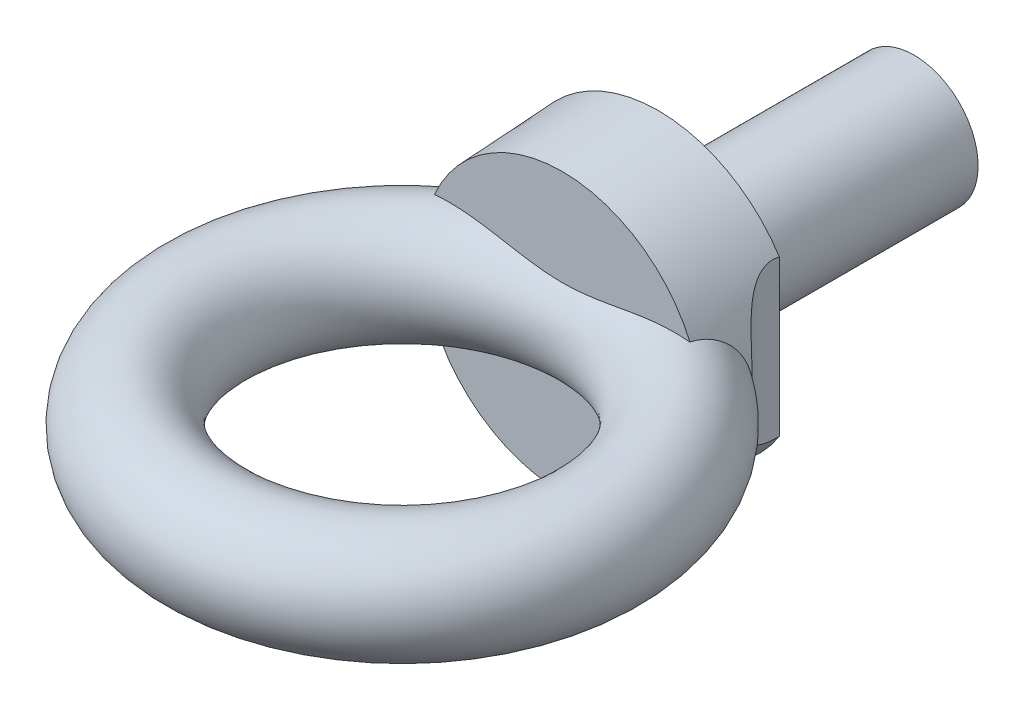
ISO-10303-21;
HEADER;
FILE_DESCRIPTION(('STEP AP214'),'2;1');
FILE_NAME('part.step','',(''),(''),'','','');
FILE_SCHEMA(('AUTOMOTIVE_DESIGN { 1 0 10303 214 1 1 1 1 }'));
ENDSEC;
DATA;
#1=APPLICATION_CONTEXT('core data for automotive mechanical design processes');
#2=APPLICATION_PROTOCOL_DEFINITION('international standard','automotive_design',2000,#1);
#3=PRODUCT_CONTEXT('',#1,'mechanical');
#4=PRODUCT('Part','Part','',(#3));
#5=PRODUCT_RELATED_PRODUCT_CATEGORY('part','',(#4));
#6=PRODUCT_DEFINITION_FORMATION('','',#4);
#7=PRODUCT_DEFINITION_CONTEXT('part definition',#1,'design');
#8=PRODUCT_DEFINITION('design','',#6,#7);
#9=PRODUCT_DEFINITION_SHAPE('','',#8);
#10=(LENGTH_UNIT() NAMED_UNIT(*) SI_UNIT(.MILLI.,.METRE.));
#11=(NAMED_UNIT(*) PLANE_ANGLE_UNIT() SI_UNIT($,.RADIAN.));
#12=(NAMED_UNIT(*) SI_UNIT($,.STERADIAN.) SOLID_ANGLE_UNIT());
#13=UNCERTAINTY_MEASURE_WITH_UNIT(LENGTH_MEASURE(1.E-05),#10,'distance_accuracy_value','');
#14=(GEOMETRIC_REPRESENTATION_CONTEXT(3) GLOBAL_UNCERTAINTY_ASSIGNED_CONTEXT((#13)) GLOBAL_UNIT_ASSIGNED_CONTEXT((#10,
#11,#12)) REPRESENTATION_CONTEXT('',''));
#15=CARTESIAN_POINT('',(0.,0.,0.));
#16=DIRECTION('',(0.,0.,1.));
#17=DIRECTION('',(1.,0.,0.));
#18=AXIS2_PLACEMENT_3D('',#15,#16,#17);
#19=CARTESIAN_POINT('',(0.,0.,12.));
#20=DIRECTION('',(0.,0.,-1.));
#21=DIRECTION('',(-1.,0.,0.));
#22=AXIS2_PLACEMENT_3D('',#19,#20,#21);
#23=CONICAL_SURFACE('',#22,17.4,0.0499583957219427);
#24=CARTESIAN_POINT('',(0.,0.,0.));
#25=DIRECTION('',(0.,0.,-1.));
#26=DIRECTION('',(-1.,0.,0.));
#27=AXIS2_PLACEMENT_3D('',#24,#25,#26);
#28=CIRCLE('',#27,18.);
#29=CARTESIAN_POINT('',(15.1556328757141,-9.71116842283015,0.));
#30=VERTEX_POINT('',#29);
#31=CARTESIAN_POINT('',(-15.1556328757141,-9.71116842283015,0.));
#32=VERTEX_POINT('',#31);
#33=EDGE_CURVE('E98',#30,#32,#28,.T.);
#34=ORIENTED_EDGE('',*,*,#33,.F.);
#35=CARTESIAN_POINT('',(15.155666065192,-9.71113516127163,-0.000199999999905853));
#36=CARTESIAN_POINT('',(15.1391001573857,-9.72773806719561,0.0994587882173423));
#37=CARTESIAN_POINT('',(15.1249930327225,-9.74035112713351,0.200195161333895));
#38=CARTESIAN_POINT('',(15.1018637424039,-9.75751734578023,0.402905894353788));
#39=CARTESIAN_POINT('',(15.0928403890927,-9.76207238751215,0.504879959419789));
#40=CARTESIAN_POINT('',(15.0800799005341,-9.76304700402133,0.70852979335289));
#41=CARTESIAN_POINT('',(15.0763086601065,-9.75951946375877,0.810203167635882));
#42=CARTESIAN_POINT('',(15.0739246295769,-9.74453525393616,1.01301697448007));
#43=CARTESIAN_POINT('',(15.0753117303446,-9.73307875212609,1.11415741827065));
#44=CARTESIAN_POINT('',(15.0830999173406,-9.70245408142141,1.31501551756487));
#45=CARTESIAN_POINT('',(15.0894985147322,-9.68328974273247,1.41473385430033));
#46=CARTESIAN_POINT('',(15.1070344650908,-9.63757620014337,1.6120547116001));
#47=CARTESIAN_POINT('',(15.1181738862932,-9.6110237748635,1.70965628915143));
#48=CARTESIAN_POINT('',(15.1582017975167,-9.52082660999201,1.99836007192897));
#49=CARTESIAN_POINT('',(15.1936997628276,-9.44664259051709,2.18535745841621));
#50=CARTESIAN_POINT('',(15.2878284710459,-9.25543862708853,2.58292554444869));
#51=CARTESIAN_POINT('',(15.3497990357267,-9.13262817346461,2.7898684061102));
#52=CARTESIAN_POINT('',(15.4873886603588,-8.85820942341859,3.17865256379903));
#53=CARTESIAN_POINT('',(15.5630286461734,-8.70655695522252,3.36045460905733));
#54=CARTESIAN_POINT('',(15.69848391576,-8.42844204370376,3.64931957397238));
#55=CARTESIAN_POINT('',(15.7564844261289,-8.30752379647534,3.76272040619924));
#56=CARTESIAN_POINT('',(15.874406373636,-8.05621164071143,3.97747018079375));
#57=CARTESIAN_POINT('',(15.9343285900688,-7.9258138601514,4.07881415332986));
#58=CARTESIAN_POINT('',(16.0546281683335,-7.6570050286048,4.27026047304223));
#59=CARTESIAN_POINT('',(16.1150059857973,-7.51858465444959,4.3603493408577));
#60=CARTESIAN_POINT('',(16.2349611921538,-7.2351174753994,4.53006615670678));
#61=CARTESIAN_POINT('',(16.294538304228,-7.09006845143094,4.60969056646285));
#62=CARTESIAN_POINT('',(16.4461501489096,-6.70817289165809,4.80304809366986));
#63=CARTESIAN_POINT('',(16.5368454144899,-6.46713541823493,4.90958304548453));
#64=CARTESIAN_POINT('',(16.7109393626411,-5.97445397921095,5.10215249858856));
#65=CARTESIAN_POINT('',(16.7943338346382,-5.72280401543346,5.18817521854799));
#66=CARTESIAN_POINT('',(16.9520376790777,-5.21099272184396,5.34286811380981));
#67=CARTESIAN_POINT('',(17.0263311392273,-4.95081746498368,5.41150811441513));
#68=CARTESIAN_POINT('',(17.164366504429,-4.42428143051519,5.5338297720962));
#69=CARTESIAN_POINT('',(17.2281090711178,-4.15792104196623,5.58751236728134));
#70=CARTESIAN_POINT('',(17.3282218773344,-3.69439772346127,5.66902791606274));
#71=CARTESIAN_POINT('',(17.3672997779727,-3.49834091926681,5.69991015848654));
#72=CARTESIAN_POINT('',(17.4392306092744,-3.10422140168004,5.75555721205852));
#73=CARTESIAN_POINT('',(17.4720830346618,-2.90615852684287,5.78032152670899));
#74=CARTESIAN_POINT('',(17.5610362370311,-2.30949677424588,5.84627789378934));
#75=CARTESIAN_POINT('',(17.6075212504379,-1.90847862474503,5.87912425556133));
#76=CARTESIAN_POINT('',(17.673996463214,-1.10253392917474,5.92551062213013));
#77=CARTESIAN_POINT('',(17.6939412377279,-0.69760187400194,5.93901752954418));
#78=CARTESIAN_POINT('',(17.7068870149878,0.112810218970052,5.94782138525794));
#79=CARTESIAN_POINT('',(17.6998929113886,0.518290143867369,5.94312164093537));
#80=CARTESIAN_POINT('',(17.6587378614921,1.33372784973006,5.91488614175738));
#81=CARTESIAN_POINT('',(17.6241489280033,1.74365500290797,5.89105360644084));
#82=CARTESIAN_POINT('',(17.5519739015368,2.35478746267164,5.83922858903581));
#83=CARTESIAN_POINT('',(17.5245208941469,2.55794001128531,5.81926473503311));
#84=CARTESIAN_POINT('',(17.462991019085,2.96257027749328,5.77350104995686));
#85=CARTESIAN_POINT('',(17.4289149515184,3.16404819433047,5.7477019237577));
#86=CARTESIAN_POINT('',(17.3544547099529,3.56419252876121,5.68980181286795));
#87=CARTESIAN_POINT('',(17.314092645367,3.76286623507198,5.65772281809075));
#88=CARTESIAN_POINT('',(17.2272379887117,4.15756933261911,5.58651627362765));
#89=CARTESIAN_POINT('',(17.1807463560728,4.35359913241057,5.5473898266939));
#90=CARTESIAN_POINT('',(17.0820097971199,4.74229365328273,5.46129154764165));
#91=CARTESIAN_POINT('',(17.0297695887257,4.93496098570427,5.41432613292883));
#92=CARTESIAN_POINT('',(16.919971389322,5.31635464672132,5.31157038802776));
#93=CARTESIAN_POINT('',(16.8624146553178,5.50508189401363,5.2557821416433));
#94=CARTESIAN_POINT('',(16.7477432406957,5.86174379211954,5.13949503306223));
#95=CARTESIAN_POINT('',(16.6910172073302,6.03006957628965,5.07981536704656));
#96=CARTESIAN_POINT('',(16.5742382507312,6.3619708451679,4.95120319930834));
#97=CARTESIAN_POINT('',(16.5141856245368,6.52554675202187,4.88227152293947));
#98=CARTESIAN_POINT('',(16.3915672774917,6.84694363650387,4.7341494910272));
#99=CARTESIAN_POINT('',(16.3290026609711,7.00476708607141,4.65496361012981));
#100=CARTESIAN_POINT('',(16.2023608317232,7.31356306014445,4.48522211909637));
#101=CARTESIAN_POINT('',(16.1382838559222,7.46453664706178,4.394668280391));
#102=CARTESIAN_POINT('',(16.0215324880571,7.73167309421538,4.21858795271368));
#103=CARTESIAN_POINT('',(15.9688894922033,7.8491973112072,4.13510881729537));
#104=CARTESIAN_POINT('',(15.8643578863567,8.07778175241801,3.95919496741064));
#105=CARTESIAN_POINT('',(15.8124694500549,8.18884050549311,3.86675822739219));
#106=CARTESIAN_POINT('',(15.7106114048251,8.40319928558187,3.67260118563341));
#107=CARTESIAN_POINT('',(15.6606390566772,8.50651060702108,3.57089489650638));
#108=CARTESIAN_POINT('',(15.5638217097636,8.7042305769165,3.35784295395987));
#109=CARTESIAN_POINT('',(15.5169763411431,8.79864027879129,3.24649844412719));
#110=CARTESIAN_POINT('',(15.4079197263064,9.01703820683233,2.96202946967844));
#111=CARTESIAN_POINT('',(15.3481716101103,9.13544295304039,2.78349653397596));
#112=CARTESIAN_POINT('',(15.2694665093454,9.2929856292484,2.50162269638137));
#113=CARTESIAN_POINT('',(15.2450457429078,9.34216661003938,2.40529040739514));
#114=CARTESIAN_POINT('',(15.2004583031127,9.43323137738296,2.20830038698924));
#115=CARTESIAN_POINT('',(15.1802897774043,9.47511833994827,2.10764456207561));
#116=CARTESIAN_POINT('',(15.1446220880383,9.5513625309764,1.9015025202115));
#117=CARTESIAN_POINT('',(15.1291728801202,9.58563821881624,1.79597738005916));
#118=CARTESIAN_POINT('',(15.1037791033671,9.64550336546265,1.58189282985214));
#119=CARTESIAN_POINT('',(15.0938315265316,9.67109756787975,1.4733351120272));
#120=CARTESIAN_POINT('',(15.0798666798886,9.71311066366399,1.25416653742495));
#121=CARTESIAN_POINT('',(15.0758444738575,9.72953718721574,1.14355746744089));
#122=CARTESIAN_POINT('',(15.0739810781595,9.75289213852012,0.921338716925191));
#123=CARTESIAN_POINT('',(15.0761368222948,9.75982527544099,0.809729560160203));
#124=CARTESIAN_POINT('',(15.0869955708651,9.76412721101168,0.580703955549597));
#125=CARTESIAN_POINT('',(15.0960396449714,9.76096942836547,0.463293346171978));
#126=CARTESIAN_POINT('',(15.1208602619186,9.74400790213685,0.230045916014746));
#127=CARTESIAN_POINT('',(15.1366320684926,9.73021164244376,0.114208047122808));
#128=CARTESIAN_POINT('',(15.1556660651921,9.71113516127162,-0.000200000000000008));
#129=B_SPLINE_CURVE_WITH_KNOTS('',3,(#35,#36,#37,#38,#39,#40,#41,#42,#43,#44,#45,#46,#47,#48,
#49,#50,#51,#52,#53,#54,#55,#56,#57,#58,#59,#60,#61,#62,#63,#64,#65,#66,#67,#68,#69,#70,#71,#72,
#73,#74,#75,#76,#77,#78,#79,#80,#81,#82,#83,#84,#85,#86,#87,#88,#89,#90,#91,#92,#93,#94,#95,#96,
#97,#98,#99,#100,#101,#102,#103,#104,#105,#106,#107,#108,#109,#110,#111,#112,#113,#114,#115,
#116,#117,#118,#119,#120,#121,#122,#123,#124,#125,#126,#127,#128),.UNSPECIFIED.,.F.,.F.,(4,2,2,
2,2,2,2,2,2,2,2,2,2,2,2,2,2,2,2,2,2,2,2,2,2,2,2,2,2,2,2,2,2,2,2,2,2,2,2,2,2,2,2,2,2,2,4),(0.,
0.307039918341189,0.614008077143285,0.918973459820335,1.22393239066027,1.52873996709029,
1.83368065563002,2.44357363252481,3.18515149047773,3.92787436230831,4.45408368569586,
4.98050916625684,5.50755918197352,6.03478694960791,6.86956868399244,7.7048287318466,
8.54152892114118,9.37817662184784,9.98483366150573,10.5915399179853,11.8051194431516,
13.0207734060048,14.2362065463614,15.4708659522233,16.0886138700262,16.7062872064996,
17.3218351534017,17.9372868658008,18.552237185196,19.167042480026,19.7289112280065,
20.2907298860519,20.8523042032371,21.4137911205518,21.8738378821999,22.3339889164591,
22.7934555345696,23.2528677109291,23.9171432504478,24.2494649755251,24.5816416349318,
24.9172215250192,25.2526177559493,25.5877344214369,25.9226847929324,26.2753939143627,
26.6278551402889),.UNSPECIFIED.);
#130=CARTESIAN_POINT('',(17.7027496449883,-1.94289029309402E-11,5.94500710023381));
#131=VERTEX_POINT('',#130);
#132=EDGE_CURVE('E54',#30,#131,#129,.T.);
#133=ORIENTED_EDGE('',*,*,#132,.T.);
#134=CARTESIAN_POINT('',(15.967211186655,6.9143198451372,12.0002));
#135=CARTESIAN_POINT('',(15.9898595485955,6.8872780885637,11.7989461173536));
#136=CARTESIAN_POINT('',(16.0153478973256,6.85340626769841,11.5988512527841));
#137=CARTESIAN_POINT('',(16.0717891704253,6.77125328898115,11.2022638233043));
#138=CARTESIAN_POINT('',(16.1027465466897,6.72296036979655,11.0057743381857));
#139=CARTESIAN_POINT('',(16.1699377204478,6.611149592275,10.6176399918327));
#140=CARTESIAN_POINT('',(16.2061816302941,6.54760240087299,10.4260052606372));
#141=CARTESIAN_POINT('',(16.2833131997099,6.40494797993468,10.049631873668));
#142=CARTESIAN_POINT('',(16.3241995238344,6.32584522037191,9.86489125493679));
#143=CARTESIAN_POINT('',(16.410018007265,6.15151938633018,9.50292998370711));
#144=CARTESIAN_POINT('',(16.4549697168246,6.05621624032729,9.32575243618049));
#145=CARTESIAN_POINT('',(16.5476664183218,5.84999708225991,8.98146363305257));
#146=CARTESIAN_POINT('',(16.5954117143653,5.73907936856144,8.8143534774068));
#147=CARTESIAN_POINT('',(16.6923500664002,5.50241106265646,8.49191767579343));
#148=CARTESIAN_POINT('',(16.7415404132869,5.37668704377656,8.33657171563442));
#149=CARTESIAN_POINT('',(16.8400955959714,5.11109743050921,8.03855657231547));
#150=CARTESIAN_POINT('',(16.889460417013,4.97123300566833,7.89588634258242));
#151=CARTESIAN_POINT('',(16.9832240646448,4.68973426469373,7.63469596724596));
#152=CARTESIAN_POINT('',(17.0277122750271,4.54906825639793,7.51516190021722));
#153=CARTESIAN_POINT('',(17.1146264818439,4.25752269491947,7.28831514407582));
#154=CARTESIAN_POINT('',(17.1570517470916,4.10663956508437,7.18100677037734));
#155=CARTESIAN_POINT('',(17.2388365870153,3.79574055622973,6.9791400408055));
#156=CARTESIAN_POINT('',(17.2781954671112,3.63572262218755,6.88458457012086));
#157=CARTESIAN_POINT('',(17.3529482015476,3.30764623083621,6.708596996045));
#158=CARTESIAN_POINT('',(17.3883402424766,3.13958414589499,6.62717088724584));
#159=CARTESIAN_POINT('',(17.4544149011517,2.79628257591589,6.47761775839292));
#160=CARTESIAN_POINT('',(17.4850866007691,2.62102760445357,6.4095214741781));
#161=CARTESIAN_POINT('',(17.5409294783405,2.2650081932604,6.28710706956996));
#162=CARTESIAN_POINT('',(17.5661030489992,2.08424618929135,6.2327829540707));
#163=CARTESIAN_POINT('',(17.610422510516,1.71835041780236,6.13802279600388));
#164=CARTESIAN_POINT('',(17.6295670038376,1.53321564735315,6.09758997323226));
#165=CARTESIAN_POINT('',(17.6614030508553,1.15995078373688,6.03075137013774));
#166=CARTESIAN_POINT('',(17.6740967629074,0.97182171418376,6.0043408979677));
#167=CARTESIAN_POINT('',(17.6929409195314,0.590337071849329,5.9652409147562));
#168=CARTESIAN_POINT('',(17.6989677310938,0.396948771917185,5.95281058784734));
#169=CARTESIAN_POINT('',(17.7039276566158,0.00969346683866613,5.94257574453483));
#170=CARTESIAN_POINT('',(17.7028606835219,-0.184173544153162,5.94477140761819));
#171=CARTESIAN_POINT('',(17.6936567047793,-0.571006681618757,5.96378240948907));
#172=CARTESIAN_POINT('',(17.6855202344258,-0.763972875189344,5.98059664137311));
#173=CARTESIAN_POINT('',(17.6623528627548,-1.14772214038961,6.0288072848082));
#174=CARTESIAN_POINT('',(17.6473196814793,-1.33850446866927,6.06020851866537));
#175=CARTESIAN_POINT('',(17.6106082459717,-1.71732227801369,6.13768407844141));
#176=CARTESIAN_POINT('',(17.588900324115,-1.90534148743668,6.18382395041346));
#177=CARTESIAN_POINT('',(17.5393536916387,-2.27638993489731,6.29059831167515));
#178=CARTESIAN_POINT('',(17.5115150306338,-2.45941921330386,6.35123268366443));
#179=CARTESIAN_POINT('',(17.450337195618,-2.81920984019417,6.48682383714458));
#180=CARTESIAN_POINT('',(17.416996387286,-2.99596930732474,6.56178487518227));
#181=CARTESIAN_POINT('',(17.3456143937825,-3.341795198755,6.72572273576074));
#182=CARTESIAN_POINT('',(17.3075749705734,-3.51086447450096,6.81469430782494));
#183=CARTESIAN_POINT('',(17.228009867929,-3.83882588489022,7.00556460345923));
#184=CARTESIAN_POINT('',(17.1865139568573,-3.99778759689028,7.10735616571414));
#185=CARTESIAN_POINT('',(17.1007779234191,-4.30579981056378,7.32395169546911));
#186=CARTESIAN_POINT('',(17.056537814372,-4.45485036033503,7.43875559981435));
#187=CARTESIAN_POINT('',(16.9664261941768,-4.74185325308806,7.68070495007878));
#188=CARTESIAN_POINT('',(16.9205558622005,-4.87981339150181,7.80784158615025));
#189=CARTESIAN_POINT('',(16.8282845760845,-5.1437821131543,8.07378831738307));
#190=CARTESIAN_POINT('',(16.7818836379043,-5.26979105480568,8.21259806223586));
#191=CARTESIAN_POINT('',(16.6906235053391,-5.50661791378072,8.49806794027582));
#192=CARTESIAN_POINT('',(16.6457521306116,-5.6176921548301,8.64451167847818));
#193=CARTESIAN_POINT('',(16.5576192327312,-5.82700962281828,8.94675583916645));
#194=CARTESIAN_POINT('',(16.5143577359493,-5.92525263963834,9.10255641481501));
#195=CARTESIAN_POINT('',(16.4303451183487,-6.10862207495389,9.42254402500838));
#196=CARTESIAN_POINT('',(16.389596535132,-6.19373536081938,9.58673924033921));
#197=CARTESIAN_POINT('',(16.3114677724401,-6.35058269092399,9.92214097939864));
#198=CARTESIAN_POINT('',(16.2740871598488,-6.42231845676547,10.0933465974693));
#199=CARTESIAN_POINT('',(16.2104622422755,-6.53938896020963,10.4063787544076));
#200=CARTESIAN_POINT('',(16.1834923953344,-6.5871304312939,10.5471669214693));
#201=CARTESIAN_POINT('',(16.132328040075,-6.67432500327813,10.8317768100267));
#202=CARTESIAN_POINT('',(16.1081334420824,-6.71377837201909,10.975598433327));
#203=CARTESIAN_POINT('',(16.0627481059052,-6.78452157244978,11.2652107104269));
#204=CARTESIAN_POINT('',(16.0415483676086,-6.81583611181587,11.4109939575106));
#205=CARTESIAN_POINT('',(16.0021304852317,-6.8707680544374,11.7043705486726));
#206=CARTESIAN_POINT('',(15.9839116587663,-6.89438722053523,11.8519634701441));
#207=CARTESIAN_POINT('',(15.967211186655,-6.9143198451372,12.0002));
#208=B_SPLINE_CURVE_WITH_KNOTS('',3,(#134,#135,#136,#137,#138,#139,#140,#141,#142,#143,#144,
#145,#146,#147,#148,#149,#150,#151,#152,#153,#154,#155,#156,#157,#158,#159,#160,#161,#162,#163,
#164,#165,#166,#167,#168,#169,#170,#171,#172,#173,#174,#175,#176,#177,#178,#179,#180,#181,#182,
#183,#184,#185,#186,#187,#188,#189,#190,#191,#192,#193,#194,#195,#196,#197,#198,#199,#200,#201,
#202,#203,#204,#205,#206,#207),.UNSPECIFIED.,.F.,.F.,(4,2,2,2,2,2,2,2,2,2,2,2,2,2,2,2,2,2,2,2,2,
2,2,2,2,2,2,2,2,2,2,2,2,2,2,2,4),(0.,0.612944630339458,1.22639052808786,1.84102563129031,
2.4554843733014,3.07307345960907,3.69072990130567,4.30729424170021,4.92380762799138,
5.49277626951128,6.06194512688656,6.63124253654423,7.2007991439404,7.77165395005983,
8.34225983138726,8.91299788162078,9.48354484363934,10.0645035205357,10.6454693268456,
11.2263911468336,11.8075051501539,12.3912403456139,12.9749708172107,13.5588749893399,
14.1425608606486,14.7216566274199,15.3007495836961,15.8794318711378,16.4580967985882,
17.0250221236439,17.5919567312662,18.1594547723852,18.7268797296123,19.1798694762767,
19.6328445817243,20.0844280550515,20.5359080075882),.UNSPECIFIED.);
#209=CARTESIAN_POINT('',(15.9672337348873,-6.91429293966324,12.));
#210=VERTEX_POINT('',#209);
#211=EDGE_CURVE('E95',#131,#210,#208,.T.);
#212=ORIENTED_EDGE('',*,*,#211,.T.);
#213=CARTESIAN_POINT('',(0.,0.,12.));
#214=DIRECTION('',(0.,0.,-1.));
#215=DIRECTION('',(-1.,0.,0.));
#216=AXIS2_PLACEMENT_3D('',#213,#214,#215);
#217=CIRCLE('',#216,17.4);
#218=CARTESIAN_POINT('',(-15.9672337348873,-6.91429293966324,12.));
#219=VERTEX_POINT('',#218);
#220=EDGE_CURVE('E156',#210,#219,#217,.T.);
#221=ORIENTED_EDGE('',*,*,#220,.T.);
#222=CARTESIAN_POINT('',(-15.967211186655,-6.9143198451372,12.0002));
#223=CARTESIAN_POINT('',(-15.9898595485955,-6.8872780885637,11.7989461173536));
#224=CARTESIAN_POINT('',(-16.0153478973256,-6.85340626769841,11.5988512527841));
#225=CARTESIAN_POINT('',(-16.0717891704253,-6.77125328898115,11.2022638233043));
#226=CARTESIAN_POINT('',(-16.1027465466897,-6.72296036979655,11.0057743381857));
#227=CARTESIAN_POINT('',(-16.1699377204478,-6.611149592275,10.6176399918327));
#228=CARTESIAN_POINT('',(-16.2061816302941,-6.54760240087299,10.4260052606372));
#229=CARTESIAN_POINT('',(-16.2833131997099,-6.40494797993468,10.049631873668));
#230=CARTESIAN_POINT('',(-16.3241995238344,-6.32584522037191,9.86489125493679));
#231=CARTESIAN_POINT('',(-16.410018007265,-6.15151938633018,9.50292998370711));
#232=CARTESIAN_POINT('',(-16.4549697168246,-6.05621624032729,9.32575243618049));
#233=CARTESIAN_POINT('',(-16.5476664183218,-5.84999708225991,8.98146363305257));
#234=CARTESIAN_POINT('',(-16.5954117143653,-5.73907936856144,8.8143534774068));
#235=CARTESIAN_POINT('',(-16.6923500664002,-5.50241106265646,8.49191767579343));
#236=CARTESIAN_POINT('',(-16.7415404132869,-5.37668704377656,8.33657171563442));
#237=CARTESIAN_POINT('',(-16.8400955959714,-5.11109743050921,8.03855657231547));
#238=CARTESIAN_POINT('',(-16.889460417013,-4.97123300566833,7.89588634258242));
#239=CARTESIAN_POINT('',(-16.9832240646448,-4.68973426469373,7.63469596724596));
#240=CARTESIAN_POINT('',(-17.0277122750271,-4.54906825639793,7.51516190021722));
#241=CARTESIAN_POINT('',(-17.1146264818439,-4.25752269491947,7.28831514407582));
#242=CARTESIAN_POINT('',(-17.1570517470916,-4.10663956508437,7.18100677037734));
#243=CARTESIAN_POINT('',(-17.2388365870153,-3.79574055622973,6.9791400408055));
#244=CARTESIAN_POINT('',(-17.2781954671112,-3.63572262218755,6.88458457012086));
#245=CARTESIAN_POINT('',(-17.3529482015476,-3.30764623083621,6.708596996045));
#246=CARTESIAN_POINT('',(-17.3883402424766,-3.13958414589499,6.62717088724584));
#247=CARTESIAN_POINT('',(-17.4544149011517,-2.79628257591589,6.47761775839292));
#248=CARTESIAN_POINT('',(-17.4850866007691,-2.62102760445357,6.4095214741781));
#249=CARTESIAN_POINT('',(-17.5409294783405,-2.2650081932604,6.28710706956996));
#250=CARTESIAN_POINT('',(-17.5661030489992,-2.08424618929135,6.2327829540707));
#251=CARTESIAN_POINT('',(-17.610422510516,-1.71835041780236,6.13802279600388));
#252=CARTESIAN_POINT('',(-17.6295670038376,-1.53321564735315,6.09758997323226));
#253=CARTESIAN_POINT('',(-17.6614030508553,-1.15995078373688,6.03075137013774));
#254=CARTESIAN_POINT('',(-17.6740967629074,-0.97182171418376,6.0043408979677));
#255=CARTESIAN_POINT('',(-17.6929409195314,-0.590337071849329,5.9652409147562));
#256=CARTESIAN_POINT('',(-17.6989677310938,-0.396948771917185,5.95281058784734));
#257=CARTESIAN_POINT('',(-17.7039276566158,-0.00969346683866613,5.94257574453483));
#258=CARTESIAN_POINT('',(-17.7028606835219,0.184173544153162,5.94477140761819));
#259=CARTESIAN_POINT('',(-17.6936567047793,0.571006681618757,5.96378240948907));
#260=CARTESIAN_POINT('',(-17.6855202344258,0.763972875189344,5.98059664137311));
#261=CARTESIAN_POINT('',(-17.6623528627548,1.14772214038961,6.0288072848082));
#262=CARTESIAN_POINT('',(-17.6473196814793,1.33850446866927,6.06020851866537));
#263=CARTESIAN_POINT('',(-17.6106082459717,1.71732227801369,6.13768407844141));
#264=CARTESIAN_POINT('',(-17.588900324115,1.90534148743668,6.18382395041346));
#265=CARTESIAN_POINT('',(-17.5393536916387,2.27638993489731,6.29059831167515));
#266=CARTESIAN_POINT('',(-17.5115150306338,2.45941921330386,6.35123268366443));
#267=CARTESIAN_POINT('',(-17.450337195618,2.81920984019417,6.48682383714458));
#268=CARTESIAN_POINT('',(-17.416996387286,2.99596930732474,6.56178487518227));
#269=CARTESIAN_POINT('',(-17.3456143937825,3.341795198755,6.72572273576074));
#270=CARTESIAN_POINT('',(-17.3075749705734,3.51086447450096,6.81469430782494));
#271=CARTESIAN_POINT('',(-17.228009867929,3.83882588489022,7.00556460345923));
#272=CARTESIAN_POINT('',(-17.1865139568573,3.99778759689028,7.10735616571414));
#273=CARTESIAN_POINT('',(-17.1007779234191,4.30579981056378,7.32395169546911));
#274=CARTESIAN_POINT('',(-17.056537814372,4.45485036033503,7.43875559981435));
#275=CARTESIAN_POINT('',(-16.9664261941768,4.74185325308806,7.68070495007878));
#276=CARTESIAN_POINT('',(-16.9205558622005,4.87981339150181,7.80784158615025));
#277=CARTESIAN_POINT('',(-16.8282845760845,5.1437821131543,8.07378831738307));
#278=CARTESIAN_POINT('',(-16.7818836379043,5.26979105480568,8.21259806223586));
#279=CARTESIAN_POINT('',(-16.6906235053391,5.50661791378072,8.49806794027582));
#280=CARTESIAN_POINT('',(-16.6457521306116,5.6176921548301,8.64451167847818));
#281=CARTESIAN_POINT('',(-16.5576192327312,5.82700962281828,8.94675583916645));
#282=CARTESIAN_POINT('',(-16.5143577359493,5.92525263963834,9.10255641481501));
#283=CARTESIAN_POINT('',(-16.4303451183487,6.10862207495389,9.42254402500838));
#284=CARTESIAN_POINT('',(-16.389596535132,6.19373536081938,9.58673924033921));
#285=CARTESIAN_POINT('',(-16.3114677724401,6.35058269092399,9.92214097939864));
#286=CARTESIAN_POINT('',(-16.2740871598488,6.42231845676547,10.0933465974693));
#287=CARTESIAN_POINT('',(-16.2104622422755,6.53938896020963,10.4063787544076));
#288=CARTESIAN_POINT('',(-16.1834923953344,6.5871304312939,10.5471669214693));
#289=CARTESIAN_POINT('',(-16.132328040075,6.67432500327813,10.8317768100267));
#290=CARTESIAN_POINT('',(-16.1081334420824,6.71377837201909,10.975598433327));
#291=CARTESIAN_POINT('',(-16.0627481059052,6.78452157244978,11.2652107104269));
#292=CARTESIAN_POINT('',(-16.0415483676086,6.81583611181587,11.4109939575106));
#293=CARTESIAN_POINT('',(-16.0021304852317,6.8707680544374,11.7043705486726));
#294=CARTESIAN_POINT('',(-15.9839116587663,6.89438722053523,11.8519634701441));
#295=CARTESIAN_POINT('',(-15.967211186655,6.9143198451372,12.0002));
#296=B_SPLINE_CURVE_WITH_KNOTS('',3,(#222,#223,#224,#225,#226,#227,#228,#229,#230,#231,#232,
#233,#234,#235,#236,#237,#238,#239,#240,#241,#242,#243,#244,#245,#246,#247,#248,#249,#250,#251,
#252,#253,#254,#255,#256,#257,#258,#259,#260,#261,#262,#263,#264,#265,#266,#267,#268,#269,#270,
#271,#272,#273,#274,#275,#276,#277,#278,#279,#280,#281,#282,#283,#284,#285,#286,#287,#288,#289,
#290,#291,#292,#293,#294,#295),.UNSPECIFIED.,.F.,.F.,(4,2,2,2,2,2,2,2,2,2,2,2,2,2,2,2,2,2,2,2,2,
2,2,2,2,2,2,2,2,2,2,2,2,2,2,2,4),(0.,0.612944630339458,1.22639052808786,1.84102563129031,
2.4554843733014,3.07307345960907,3.69072990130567,4.30729424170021,4.92380762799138,
5.49277626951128,6.06194512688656,6.63124253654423,7.2007991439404,7.77165395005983,
8.34225983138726,8.91299788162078,9.48354484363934,10.0645035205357,10.6454693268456,
11.2263911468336,11.8075051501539,12.3912403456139,12.9749708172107,13.5588749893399,
14.1425608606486,14.7216566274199,15.3007495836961,15.8794318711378,16.4580967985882,
17.0250221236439,17.5919567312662,18.1594547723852,18.7268797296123,19.1798694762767,
19.6328445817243,20.0844280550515,20.5359080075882),.UNSPECIFIED.);
#297=CARTESIAN_POINT('',(-17.7027496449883,-9.71445146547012E-12,5.94500710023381));
#298=VERTEX_POINT('',#297);
#299=EDGE_CURVE('E108',#219,#298,#296,.T.);
#300=ORIENTED_EDGE('',*,*,#299,.T.);
#301=CARTESIAN_POINT('',(-15.1556660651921,9.71113516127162,-0.000200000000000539));
#302=CARTESIAN_POINT('',(-15.1391001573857,9.72773806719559,0.0994587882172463));
#303=CARTESIAN_POINT('',(-15.1249930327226,9.74035112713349,0.200195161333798));
#304=CARTESIAN_POINT('',(-15.1018637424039,9.75751734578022,0.402905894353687));
#305=CARTESIAN_POINT('',(-15.0928403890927,9.76207238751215,0.504879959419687));
#306=CARTESIAN_POINT('',(-15.0800799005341,9.76304700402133,0.708529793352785));
#307=CARTESIAN_POINT('',(-15.0763086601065,9.75951946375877,0.810203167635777));
#308=CARTESIAN_POINT('',(-15.0739246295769,9.74453525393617,1.01301697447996));
#309=CARTESIAN_POINT('',(-15.0753117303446,9.7330787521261,1.11415741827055));
#310=CARTESIAN_POINT('',(-15.0830999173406,9.70245408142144,1.31501551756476));
#311=CARTESIAN_POINT('',(-15.0894985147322,9.6832897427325,1.41473385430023));
#312=CARTESIAN_POINT('',(-15.1070344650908,9.6375762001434,1.61205471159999));
#313=CARTESIAN_POINT('',(-15.1181738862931,9.61102377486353,1.70965628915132));
#314=CARTESIAN_POINT('',(-15.1582017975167,9.52082660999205,1.99836007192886));
#315=CARTESIAN_POINT('',(-15.1936997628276,9.44664259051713,2.18535745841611));
#316=CARTESIAN_POINT('',(-15.2878284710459,9.2554386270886,2.58292554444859));
#317=CARTESIAN_POINT('',(-15.3497990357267,9.13262817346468,2.78986840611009));
#318=CARTESIAN_POINT('',(-15.4873886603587,8.85820942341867,3.17865256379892));
#319=CARTESIAN_POINT('',(-15.5630286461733,8.70655695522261,3.36045460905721));
#320=CARTESIAN_POINT('',(-15.6984839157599,8.42844204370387,3.64931957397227));
#321=CARTESIAN_POINT('',(-15.7564844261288,8.30752379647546,3.76272040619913));
#322=CARTESIAN_POINT('',(-15.874406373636,8.05621164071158,3.97747018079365));
#323=CARTESIAN_POINT('',(-15.9343285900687,7.92581386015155,4.07881415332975));
#324=CARTESIAN_POINT('',(-16.0546281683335,7.65700502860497,4.27026047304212));
#325=CARTESIAN_POINT('',(-16.1150059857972,7.51858465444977,4.3603493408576));
#326=CARTESIAN_POINT('',(-16.2349611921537,7.2351174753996,4.53006615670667));
#327=CARTESIAN_POINT('',(-16.2945383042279,7.09006845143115,4.60969056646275));
#328=CARTESIAN_POINT('',(-16.4461501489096,6.70817289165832,4.80304809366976));
#329=CARTESIAN_POINT('',(-16.5368454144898,6.46713541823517,4.90958304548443));
#330=CARTESIAN_POINT('',(-16.710939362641,5.97445397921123,5.10215249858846));
#331=CARTESIAN_POINT('',(-16.7943338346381,5.72280401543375,5.1881752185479));
#332=CARTESIAN_POINT('',(-16.9520376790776,5.21099272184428,5.34286811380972));
#333=CARTESIAN_POINT('',(-17.0263311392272,4.95081746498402,5.41150811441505));
#334=CARTESIAN_POINT('',(-17.1643665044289,4.42428143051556,5.53382977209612));
#335=CARTESIAN_POINT('',(-17.2281090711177,4.15792104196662,5.58751236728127));
#336=CARTESIAN_POINT('',(-17.3282218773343,3.69439772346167,5.66902791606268));
#337=CARTESIAN_POINT('',(-17.3672997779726,3.49834091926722,5.69991015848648));
#338=CARTESIAN_POINT('',(-17.4392306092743,3.10422140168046,5.75555721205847));
#339=CARTESIAN_POINT('',(-17.4720830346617,2.9061585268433,5.78032152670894));
#340=CARTESIAN_POINT('',(-17.561036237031,2.30949677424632,5.84627789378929));
#341=CARTESIAN_POINT('',(-17.6075212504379,1.90847862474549,5.8791242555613));
#342=CARTESIAN_POINT('',(-17.6739964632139,1.10253392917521,5.92551062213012));
#343=CARTESIAN_POINT('',(-17.6939412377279,0.697601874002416,5.93901752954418));
#344=CARTESIAN_POINT('',(-17.7068870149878,-0.11281021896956,5.94782138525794));
#345=CARTESIAN_POINT('',(-17.6998929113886,-0.518290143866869,5.94312164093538));
#346=CARTESIAN_POINT('',(-17.6587378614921,-1.33372784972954,5.91488614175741));
#347=CARTESIAN_POINT('',(-17.6241489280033,-1.74365500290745,5.89105360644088));
#348=CARTESIAN_POINT('',(-17.5519739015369,-2.35478746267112,5.83922858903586));
#349=CARTESIAN_POINT('',(-17.524520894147,-2.55794001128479,5.81926473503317));
#350=CARTESIAN_POINT('',(-17.4629910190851,-2.96257027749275,5.77350104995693));
#351=CARTESIAN_POINT('',(-17.4289149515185,-3.16404819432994,5.74770192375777));
#352=CARTESIAN_POINT('',(-17.354454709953,-3.56419252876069,5.68980181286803));
#353=CARTESIAN_POINT('',(-17.3140926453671,-3.76286623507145,5.65772281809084));
#354=CARTESIAN_POINT('',(-17.2272379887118,-4.15756933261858,5.58651627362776));
#355=CARTESIAN_POINT('',(-17.1807463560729,-4.35359913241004,5.54738982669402));
#356=CARTESIAN_POINT('',(-17.0820097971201,-4.7422936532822,5.46129154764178));
#357=CARTESIAN_POINT('',(-17.0297695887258,-4.93496098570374,5.41432613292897));
#358=CARTESIAN_POINT('',(-16.9199713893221,-5.31635464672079,5.31157038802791));
#359=CARTESIAN_POINT('',(-16.862414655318,-5.5050818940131,5.25578214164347));
#360=CARTESIAN_POINT('',(-16.7477432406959,-5.86174379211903,5.13949503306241));
#361=CARTESIAN_POINT('',(-16.6910172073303,-6.03006957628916,5.07981536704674));
#362=CARTESIAN_POINT('',(-16.5742382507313,-6.36197084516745,4.95120319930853));
#363=CARTESIAN_POINT('',(-16.514185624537,-6.52554675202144,4.88227152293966));
#364=CARTESIAN_POINT('',(-16.3915672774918,-6.84694363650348,4.73414949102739));
#365=CARTESIAN_POINT('',(-16.3290026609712,-7.00476708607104,4.65496361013));
#366=CARTESIAN_POINT('',(-16.2023608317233,-7.31356306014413,4.48522211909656));
#367=CARTESIAN_POINT('',(-16.1382838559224,-7.46453664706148,4.3946682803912));
#368=CARTESIAN_POINT('',(-16.0215324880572,-7.73167309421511,4.21858795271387));
#369=CARTESIAN_POINT('',(-15.9688894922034,-7.84919731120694,4.13510881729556));
#370=CARTESIAN_POINT('',(-15.8643578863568,-8.07778175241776,3.95919496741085));
#371=CARTESIAN_POINT('',(-15.812469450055,-8.18884050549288,3.8667582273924));
#372=CARTESIAN_POINT('',(-15.7106114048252,-8.40319928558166,3.67260118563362));
#373=CARTESIAN_POINT('',(-15.6606390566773,-8.50651060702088,3.57089489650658));
#374=CARTESIAN_POINT('',(-15.5638217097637,-8.70423057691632,3.35784295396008));
#375=CARTESIAN_POINT('',(-15.5169763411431,-8.79864027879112,3.2464984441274));
#376=CARTESIAN_POINT('',(-15.4079197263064,-9.0170382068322,2.96202946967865));
#377=CARTESIAN_POINT('',(-15.3481716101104,-9.13544295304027,2.78349653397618));
#378=CARTESIAN_POINT('',(-15.2694665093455,-9.2929856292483,2.50162269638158));
#379=CARTESIAN_POINT('',(-15.2450457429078,-9.34216661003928,2.40529040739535));
#380=CARTESIAN_POINT('',(-15.2004583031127,-9.43323137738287,2.20830038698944));
#381=CARTESIAN_POINT('',(-15.1802897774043,-9.47511833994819,2.10764456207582));
#382=CARTESIAN_POINT('',(-15.1446220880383,-9.55136253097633,1.9015025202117));
#383=CARTESIAN_POINT('',(-15.1291728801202,-9.58563821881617,1.79597738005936));
#384=CARTESIAN_POINT('',(-15.1037791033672,-9.6455033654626,1.58189282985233));
#385=CARTESIAN_POINT('',(-15.0938315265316,-9.67109756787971,1.4733351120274));
#386=CARTESIAN_POINT('',(-15.0798666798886,-9.71311066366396,1.25416653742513));
#387=CARTESIAN_POINT('',(-15.0758444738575,-9.72953718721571,1.14355746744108));
#388=CARTESIAN_POINT('',(-15.0739810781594,-9.7528921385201,0.921338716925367));
#389=CARTESIAN_POINT('',(-15.0761368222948,-9.75982527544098,0.809729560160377));
#390=CARTESIAN_POINT('',(-15.0869955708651,-9.76412721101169,0.580703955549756));
#391=CARTESIAN_POINT('',(-15.0960396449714,-9.76096942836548,0.463293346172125));
#392=CARTESIAN_POINT('',(-15.1208602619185,-9.74400790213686,0.230045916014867));
#393=CARTESIAN_POINT('',(-15.1366320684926,-9.73021164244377,0.114208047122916));
#394=CARTESIAN_POINT('',(-15.155666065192,-9.71113516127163,-0.000199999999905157));
#395=B_SPLINE_CURVE_WITH_KNOTS('',3,(#301,#302,#303,#304,#305,#306,#307,#308,#309,#310,#311,
#312,#313,#314,#315,#316,#317,#318,#319,#320,#321,#322,#323,#324,#325,#326,#327,#328,#329,#330,
#331,#332,#333,#334,#335,#336,#337,#338,#339,#340,#341,#342,#343,#344,#345,#346,#347,#348,#349,
#350,#351,#352,#353,#354,#355,#356,#357,#358,#359,#360,#361,#362,#363,#364,#365,#366,#367,#368,
#369,#370,#371,#372,#373,#374,#375,#376,#377,#378,#379,#380,#381,#382,#383,#384,#385,#386,#387,
#388,#389,#390,#391,#392,#393,#394),.UNSPECIFIED.,.F.,.F.,(4,2,2,2,2,2,2,2,2,2,2,2,2,2,2,2,2,2,
2,2,2,2,2,2,2,2,2,2,2,2,2,2,2,2,2,2,2,2,2,2,2,2,2,2,2,2,4),(0.,0.307039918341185,
0.614008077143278,0.918973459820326,1.22393239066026,1.52873996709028,1.83368065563,
2.44357363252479,3.18515149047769,3.92787436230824,4.45408368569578,4.98050916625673,
5.50755918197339,6.03478694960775,6.86956868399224,7.70482873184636,8.5415289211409,
9.37817662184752,9.98483366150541,10.591539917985,11.8051194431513,13.0207734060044,
14.236206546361,15.4708659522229,16.0886138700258,16.7062872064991,17.3218351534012,
17.9372868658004,18.5522371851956,19.1670424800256,19.7289112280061,20.2907298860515,
20.8523042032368,21.4137911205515,21.8738378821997,22.3339889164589,22.7934555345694,
23.2528677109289,23.9171432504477,24.249464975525,24.5816416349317,24.9172215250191,
25.2526177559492,25.5877344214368,25.9226847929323,26.2753939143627,26.6278551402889),.UNSPECIFIED.);
#396=EDGE_CURVE('E99',#298,#32,#395,.T.);
#397=ORIENTED_EDGE('',*,*,#396,.T.);
#398=EDGE_LOOP('',(#34,#133,#212,#221,#300,#397));
#399=FACE_BOUND('',#398,.T.);
#400=ADVANCED_FACE('F38',(#399),#23,.T.);
#401=CARTESIAN_POINT('',(0.,0.,12.));
#402=DIRECTION('',(0.,0.,-1.));
#403=DIRECTION('',(-1.,0.,0.));
#404=AXIS2_PLACEMENT_3D('',#401,#402,#403);
#405=PLANE('',#404);
#406=ORIENTED_EDGE('',*,*,#220,.F.);
#407=CARTESIAN_POINT('',(0.,5.3619026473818,12.));
#408=CARTESIAN_POINT('',(0.276856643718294,5.36189780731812,12.));
#409=CARTESIAN_POINT('',(0.553706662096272,5.36674583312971,12.));
#410=CARTESIAN_POINT('',(1.1070799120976,5.38588839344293,12.));
#411=CARTESIAN_POINT('',(1.38360314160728,5.40018298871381,12.));
#412=CARTESIAN_POINT('',(1.93612508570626,5.43755047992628,12.));
#413=CARTESIAN_POINT('',(2.21212362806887,5.46062588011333,12.));
#414=CARTESIAN_POINT('',(2.76335885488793,5.51450828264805,12.));
#415=CARTESIAN_POINT('',(3.0385955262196,5.54531541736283,12.));
#416=CARTESIAN_POINT('',(3.86557661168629,5.6477391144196,12.));
#417=CARTESIAN_POINT('',(4.41609047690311,5.72916718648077,12.));
#418=CARTESIAN_POINT('',(5.51467985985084,5.9062611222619,12.));
#419=CARTESIAN_POINT('',(6.06275537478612,6.00192700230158,12.));
#420=CARTESIAN_POINT('',(7.16352179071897,6.19654393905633,12.));
#421=CARTESIAN_POINT('',(7.71620870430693,6.29551713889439,12.));
#422=CARTESIAN_POINT('',(8.82319460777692,6.48468542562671,12.));
#423=CARTESIAN_POINT('',(9.3774937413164,6.57487970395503,12.));
#424=CARTESIAN_POINT('',(10.486885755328,6.73571670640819,12.));
#425=CARTESIAN_POINT('',(11.0419676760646,6.80643219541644,12.));
#426=CARTESIAN_POINT('',(12.1550334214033,6.91873472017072,12.));
#427=CARTESIAN_POINT('',(12.7130158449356,6.96033470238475,12.));
#428=CARTESIAN_POINT('',(13.6886534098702,6.99873722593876,12.));
#429=CARTESIAN_POINT('',(14.105946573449,7.00423549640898,12.));
#430=CARTESIAN_POINT('',(14.9405427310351,6.98904273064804,12.));
#431=CARTESIAN_POINT('',(15.3578453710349,6.96832725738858,12.));
#432=CARTESIAN_POINT('',(16.188554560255,6.8962059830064,12.));
#433=CARTESIAN_POINT('',(16.6019693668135,6.8449002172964,12.));
#434=CARTESIAN_POINT('',(17.4226451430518,6.70703207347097,12.));
#435=CARTESIAN_POINT('',(17.8299107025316,6.62049749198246,12.));
#436=CARTESIAN_POINT('',(18.7335682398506,6.38095588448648,12.));
#437=CARTESIAN_POINT('',(19.2271217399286,6.21680831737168,12.));
#438=CARTESIAN_POINT('',(20.1848043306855,5.8171723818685,12.));
#439=CARTESIAN_POINT('',(20.6489558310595,5.58173915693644,12.));
#440=CARTESIAN_POINT('',(21.4415387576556,5.08705918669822,12.));
#441=CARTESIAN_POINT('',(21.7786015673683,4.84186524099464,12.));
#442=CARTESIAN_POINT('',(22.2508865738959,4.43582493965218,12.));
#443=CARTESIAN_POINT('',(22.4027497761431,4.29411944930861,12.));
#444=CARTESIAN_POINT('',(22.6936582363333,3.99805607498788,12.));
#445=CARTESIAN_POINT('',(22.832705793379,3.84370046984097,12.));
#446=CARTESIAN_POINT('',(23.0726957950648,3.55122582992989,12.));
#447=CARTESIAN_POINT('',(23.1760283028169,3.41506292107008,12.));
#448=CARTESIAN_POINT('',(23.3715323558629,3.13495750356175,12.));
#449=CARTESIAN_POINT('',(23.4637060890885,2.9910165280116,12.));
#450=CARTESIAN_POINT('',(23.6357727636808,2.69598946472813,12.));
#451=CARTESIAN_POINT('',(23.7156677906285,2.54490459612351,12.));
#452=CARTESIAN_POINT('',(23.8621282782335,2.2363866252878,12.));
#453=CARTESIAN_POINT('',(23.9286935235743,2.07895342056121,12.));
#454=CARTESIAN_POINT('',(24.0478550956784,1.75786204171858,12.));
#455=CARTESIAN_POINT('',(24.1003706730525,1.59417381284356,12.));
#456=CARTESIAN_POINT('',(24.1901042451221,1.26264321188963,12.));
#457=CARTESIAN_POINT('',(24.2273220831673,1.09480079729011,12.));
#458=CARTESIAN_POINT('',(24.28582753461,0.756410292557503,12.));
#459=CARTESIAN_POINT('',(24.3071201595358,0.585863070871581,12.));
#460=CARTESIAN_POINT('',(24.333422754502,0.243523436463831,12.));
#461=CARTESIAN_POINT('',(24.3384341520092,0.0717311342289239,12.));
#462=CARTESIAN_POINT('',(24.3324014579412,-0.254907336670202,12.));
#463=CARTESIAN_POINT('',(24.3228652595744,-0.409783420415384,12.));
#464=CARTESIAN_POINT('',(24.2905806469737,-0.718206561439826,12.));
#465=CARTESIAN_POINT('',(24.26782778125,-0.871753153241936,12.));
#466=CARTESIAN_POINT('',(24.209439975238,-1.17628745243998,12.));
#467=CARTESIAN_POINT('',(24.1738117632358,-1.32727645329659,12.));
#468=CARTESIAN_POINT('',(24.0901398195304,-1.62582687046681,12.));
#469=CARTESIAN_POINT('',(24.0420913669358,-1.77338696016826,12.));
#470=CARTESIAN_POINT('',(23.9343207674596,-2.0637962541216,12.));
#471=CARTESIAN_POINT('',(23.8746253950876,-2.20665540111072,12.));
#472=CARTESIAN_POINT('',(23.7442100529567,-2.48727017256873,12.));
#473=CARTESIAN_POINT('',(23.6734861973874,-2.62502397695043,12.));
#474=CARTESIAN_POINT('',(23.4459487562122,-3.02957013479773,12.));
#475=CARTESIAN_POINT('',(23.2736989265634,-3.28783350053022,12.));
#476=CARTESIAN_POINT('',(22.8747388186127,-3.8036906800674,12.));
#477=CARTESIAN_POINT('',(22.6441780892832,-4.05827096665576,12.));
#478=CARTESIAN_POINT('',(22.149816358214,-4.53274658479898,12.));
#479=CARTESIAN_POINT('',(21.8859999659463,-4.75262575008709,12.));
#480=CARTESIAN_POINT('',(21.3976398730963,-5.1102868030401,12.));
#481=CARTESIAN_POINT('',(21.1782722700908,-5.25525928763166,12.));
#482=CARTESIAN_POINT('',(20.7275571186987,-5.5253791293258,12.));
#483=CARTESIAN_POINT('',(20.4962046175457,-5.65051820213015,12.));
#484=CARTESIAN_POINT('',(20.0236697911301,-5.88198797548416,12.));
#485=CARTESIAN_POINT('',(19.7824659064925,-5.98827436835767,12.));
#486=CARTESIAN_POINT('',(19.2929279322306,-6.18273205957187,12.));
#487=CARTESIAN_POINT('',(19.0445939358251,-6.27090359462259,12.));
#488=CARTESIAN_POINT('',(18.4168603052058,-6.47020901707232,12.));
#489=CARTESIAN_POINT('',(18.0340793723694,-6.5707433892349,12.));
#490=CARTESIAN_POINT('',(17.2611372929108,-6.73774335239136,12.));
#491=CARTESIAN_POINT('',(16.870972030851,-6.80418932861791,12.));
#492=CARTESIAN_POINT('',(16.0868318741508,-6.90705821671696,12.));
#493=CARTESIAN_POINT('',(15.6928573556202,-6.94348406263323,12.));
#494=CARTESIAN_POINT('',(14.9035887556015,-6.99028969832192,12.));
#495=CARTESIAN_POINT('',(14.5082950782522,-7.00067684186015,12.));
#496=CARTESIAN_POINT('',(13.2610204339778,-6.99843298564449,12.));
#497=CARTESIAN_POINT('',(12.40909784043,-6.94533867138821,12.));
#498=CARTESIAN_POINT('',(11.1368421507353,-6.8154859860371,12.));
#499=CARTESIAN_POINT('',(10.7133402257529,-6.76376837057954,12.));
#500=CARTESIAN_POINT('',(9.86801226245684,-6.64796470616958,12.));
#501=CARTESIAN_POINT('',(9.44618610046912,-6.58387958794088,12.));
#502=CARTESIAN_POINT('',(8.60439109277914,-6.44795177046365,12.));
#503=CARTESIAN_POINT('',(8.18442056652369,-6.3761190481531,12.));
#504=CARTESIAN_POINT('',(7.34502127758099,-6.22931874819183,12.));
#505=CARTESIAN_POINT('',(6.92559253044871,-6.15435108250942,12.));
#506=CARTESIAN_POINT('',(6.08652666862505,-6.00629076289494,12.));
#507=CARTESIAN_POINT('',(5.66688965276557,-5.93319755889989,12.));
#508=CARTESIAN_POINT('',(4.82640213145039,-5.79414322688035,12.));
#509=CARTESIAN_POINT('',(4.40555162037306,-5.72818213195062,12.));
#510=CARTESIAN_POINT('',(3.55867924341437,-5.60832270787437,12.));
#511=CARTESIAN_POINT('',(3.13264282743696,-5.5545241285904,12.));
#512=CARTESIAN_POINT('',(2.27866482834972,-5.46481659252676,12.));
#513=CARTESIAN_POINT('',(1.85072342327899,-5.42890599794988,12.));
#514=CARTESIAN_POINT('',(0.994119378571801,-5.37888974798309,12.));
#515=CARTESIAN_POINT('',(0.565458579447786,-5.36475372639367,12.));
#516=CARTESIAN_POINT('',(-0.291996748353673,-5.35983599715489,12.));
#517=CARTESIAN_POINT('',(-0.720791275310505,-5.36905400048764,12.));
#518=CARTESIAN_POINT('',(-1.58132273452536,-5.40995650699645,12.));
#519=CARTESIAN_POINT('',(-2.01304925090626,-5.44185218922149,12.));
#520=CARTESIAN_POINT('',(-2.87464157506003,-5.52476593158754,12.));
#521=CARTESIAN_POINT('',(-3.30450717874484,-5.57578603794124,12.));
#522=CARTESIAN_POINT('',(-4.16306008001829,-5.69195394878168,12.));
#523=CARTESIAN_POINT('',(-4.59174381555,-5.75712726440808,12.));
#524=CARTESIAN_POINT('',(-5.44770929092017,-5.8958713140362,12.));
#525=CARTESIAN_POINT('',(-5.87499103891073,-5.96944199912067,12.));
#526=CARTESIAN_POINT('',(-6.75619948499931,-6.12413153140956,12.));
#527=CARTESIAN_POINT('',(-7.21009333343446,-6.20543290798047,12.));
#528=CARTESIAN_POINT('',(-8.1184659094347,-6.3648146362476,12.));
#529=CARTESIAN_POINT('',(-8.57294464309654,-6.44289495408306,12.));
#530=CARTESIAN_POINT('',(-9.4836263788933,-6.58990408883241,12.));
#531=CARTESIAN_POINT('',(-9.93983005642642,-6.65882883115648,12.));
#532=CARTESIAN_POINT('',(-10.8542734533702,-6.78178025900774,12.));
#533=CARTESIAN_POINT('',(-11.3125130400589,-6.83580790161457,12.));
#534=CARTESIAN_POINT('',(-12.2234193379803,-6.92263732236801,12.));
#535=CARTESIAN_POINT('',(-12.676052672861,-6.9557757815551,12.));
#536=CARTESIAN_POINT('',(-13.5826719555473,-6.9968243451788,12.));
#537=CARTESIAN_POINT('',(-14.0366581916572,-7.00472862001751,12.));
#538=CARTESIAN_POINT('',(-14.9429005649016,-6.98971258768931,12.));
#539=CARTESIAN_POINT('',(-15.3951578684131,-6.9668827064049,12.));
#540=CARTESIAN_POINT('',(-16.296210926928,-6.88475533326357,12.));
#541=CARTESIAN_POINT('',(-16.7450091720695,-6.82548716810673,12.));
#542=CARTESIAN_POINT('',(-17.4729871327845,-6.6937686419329,12.));
#543=CARTESIAN_POINT('',(-17.7544544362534,-6.63396566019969,12.));
#544=CARTESIAN_POINT('',(-18.3127403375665,-6.49560206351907,12.));
#545=CARTESIAN_POINT('',(-18.5895581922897,-6.4170384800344,12.));
#546=CARTESIAN_POINT('',(-19.4117457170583,-6.15028070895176,12.));
#547=CARTESIAN_POINT('',(-19.9477997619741,-5.93119480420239,12.));
#548=CARTESIAN_POINT('',(-20.8502793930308,-5.46282981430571,12.));
#549=CARTESIAN_POINT('',(-21.2267405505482,-5.23310213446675,12.));
#550=CARTESIAN_POINT('',(-21.7599626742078,-4.84597357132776,12.));
#551=CARTESIAN_POINT('',(-21.9323674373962,-4.70993254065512,12.));
#552=CARTESIAN_POINT('',(-22.2648821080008,-4.42351870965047,12.));
#553=CARTESIAN_POINT('',(-22.4249944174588,-4.2731487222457,12.));
#554=CARTESIAN_POINT('',(-22.7016601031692,-3.98823915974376,12.));
#555=CARTESIAN_POINT('',(-22.820710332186,-3.85611846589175,12.));
#556=CARTESIAN_POINT('',(-23.0480564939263,-3.58293976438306,12.));
#557=CARTESIAN_POINT('',(-23.1563546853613,-3.44188364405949,12.));
#558=CARTESIAN_POINT('',(-23.3609846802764,-3.15124724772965,12.));
#559=CARTESIAN_POINT('',(-23.4573121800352,-3.00166393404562,12.));
#560=CARTESIAN_POINT('',(-23.6366485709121,-2.6947937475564,12.));
#561=CARTESIAN_POINT('',(-23.7196640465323,-2.53751073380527,12.));
#562=CARTESIAN_POINT('',(-23.871769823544,-2.21495282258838,12.));
#563=CARTESIAN_POINT('',(-23.9407563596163,-2.04962884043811,12.));
#564=CARTESIAN_POINT('',(-24.0629441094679,-1.71322698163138,12.));
#565=CARTESIAN_POINT('',(-24.1161450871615,-1.5421490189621,12.));
#566=CARTESIAN_POINT('',(-24.2058149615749,-1.19574992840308,12.));
#567=CARTESIAN_POINT('',(-24.2422928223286,-1.02043112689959,12.));
#568=CARTESIAN_POINT('',(-24.2978873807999,-0.66706794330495,12.));
#569=CARTESIAN_POINT('',(-24.3170062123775,-0.489023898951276,12.));
#570=CARTESIAN_POINT('',(-24.3363252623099,-0.1529442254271,12.));
#571=CARTESIAN_POINT('',(-24.3384861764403,0.00498166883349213,12.));
#572=CARTESIAN_POINT('',(-24.3289923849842,0.320417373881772,12.));
#573=CARTESIAN_POINT('',(-24.3173381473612,0.477927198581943,12.));
#574=CARTESIAN_POINT('',(-24.2803899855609,0.791297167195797,12.));
#575=CARTESIAN_POINT('',(-24.2550991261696,0.947157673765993,12.));
#576=CARTESIAN_POINT('',(-24.191245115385,1.25613282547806,12.));
#577=CARTESIAN_POINT('',(-24.1526817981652,1.40924743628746,12.));
#578=CARTESIAN_POINT('',(-24.0640945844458,1.70739534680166,12.));
#579=CARTESIAN_POINT('',(-24.0144263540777,1.85253470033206,12.));
#580=CARTESIAN_POINT('',(-23.9036675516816,2.13843313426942,12.));
#581=CARTESIAN_POINT('',(-23.842573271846,2.2791907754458,12.));
#582=CARTESIAN_POINT('',(-23.709701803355,2.555515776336,12.));
#583=CARTESIAN_POINT('',(-23.6379273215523,2.69108444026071,12.));
#584=CARTESIAN_POINT('',(-23.4844341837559,2.9565197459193,12.));
#585=CARTESIAN_POINT('',(-23.4027118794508,3.0863842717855,12.));
#586=CARTESIAN_POINT('',(-23.2227279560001,3.35079126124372,12.));
#587=CARTESIAN_POINT('',(-23.1236486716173,3.48477765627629,12.));
#588=CARTESIAN_POINT('',(-22.9157682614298,3.74500916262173,12.));
#589=CARTESIAN_POINT('',(-22.8069632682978,3.87125116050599,12.));
#590=CARTESIAN_POINT('',(-22.4674573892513,4.23790629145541,12.));
#591=CARTESIAN_POINT('',(-22.223603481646,4.46633834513,12.));
#592=CARTESIAN_POINT('',(-21.7744774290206,4.83603458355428,12.));
#593=CARTESIAN_POINT('',(-21.5751442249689,4.98469977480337,12.));
#594=CARTESIAN_POINT('',(-21.1640926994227,5.2639844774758,12.));
#595=CARTESIAN_POINT('',(-20.9523696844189,5.39459708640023,12.));
#596=CARTESIAN_POINT('',(-20.5186859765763,5.63843977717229,12.));
#597=CARTESIAN_POINT('',(-20.2967069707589,5.75163706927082,12.));
#598=CARTESIAN_POINT('',(-19.8449719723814,5.96114672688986,12.));
#599=CARTESIAN_POINT('',(-19.6152159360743,6.05745899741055,12.));
#600=CARTESIAN_POINT('',(-19.0427622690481,6.27468090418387,12.));
#601=CARTESIAN_POINT('',(-18.6966344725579,6.38658644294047,12.));
#602=CARTESIAN_POINT('',(-17.9958403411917,6.57951250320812,12.));
#603=CARTESIAN_POINT('',(-17.641169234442,6.66051531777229,12.));
#604=CARTESIAN_POINT('',(-16.9266409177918,6.79479221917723,12.));
#605=CARTESIAN_POINT('',(-16.5667829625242,6.84806227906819,12.));
#606=CARTESIAN_POINT('',(-15.8444164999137,6.93001302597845,12.));
#607=CARTESIAN_POINT('',(-15.481908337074,6.95869685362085,12.));
#608=CARTESIAN_POINT('',(-14.5896242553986,7.00277668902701,12.));
#609=CARTESIAN_POINT('',(-14.059257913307,7.00607555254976,12.));
#610=CARTESIAN_POINT('',(-12.9995402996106,6.976042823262,12.));
#611=CARTESIAN_POINT('',(-12.4701897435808,6.94269115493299,12.));
#612=CARTESIAN_POINT('',(-11.4117510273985,6.84778946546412,12.));
#613=CARTESIAN_POINT('',(-10.8826747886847,6.78611310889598,12.));
#614=CARTESIAN_POINT('',(-9.82745051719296,6.64316237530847,12.));
#615=CARTESIAN_POINT('',(-9.30130166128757,6.5618938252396,12.));
#616=CARTESIAN_POINT('',(-8.4099096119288,6.41480171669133,12.));
#617=CARTESIAN_POINT('',(-8.04419258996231,6.35175424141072,12.));
#618=CARTESIAN_POINT('',(-7.31313263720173,6.2235394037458,12.));
#619=CARTESIAN_POINT('',(-6.94778970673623,6.15837203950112,12.));
#620=CARTESIAN_POINT('',(-6.21659676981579,6.02915897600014,12.));
#621=CARTESIAN_POINT('',(-5.85074659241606,5.96511422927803,12.));
#622=CARTESIAN_POINT('',(-5.1182489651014,5.8416787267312,12.));
#623=CARTESIAN_POINT('',(-4.75160151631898,5.78228796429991,12.));
#624=CARTESIAN_POINT('',(-4.02099807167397,5.67234018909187,12.));
#625=CARTESIAN_POINT('',(-3.65705576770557,5.62169470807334,12.));
#626=CARTESIAN_POINT('',(-3.11008878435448,5.55428933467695,12.));
#627=CARTESIAN_POINT('',(-2.92759223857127,5.53324814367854,12.));
#628=CARTESIAN_POINT('',(-2.5622432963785,5.49439335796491,12.));
#629=CARTESIAN_POINT('',(-2.37939087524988,5.47657999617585,12.));
#630=CARTESIAN_POINT('',(-1.83123167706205,5.42859448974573,12.));
#631=CARTESIAN_POINT('',(-1.46543440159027,5.40376397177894,12.));
#632=CARTESIAN_POINT('',(-0.73308753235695,5.37042148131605,12.));
#633=CARTESIAN_POINT('',(-0.366537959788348,5.36190905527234,12.));
#634=CARTESIAN_POINT('',(0.,5.3619026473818,12.));
#635=B_SPLINE_CURVE_WITH_KNOTS('',3,(#407,#408,#409,#410,#411,#412,#413,#414,#415,#416,#417,
#418,#419,#420,#421,#422,#423,#424,#425,#426,#427,#428,#429,#430,#431,#432,#433,#434,#435,#436,
#437,#438,#439,#440,#441,#442,#443,#444,#445,#446,#447,#448,#449,#450,#451,#452,#453,#454,#455,
#456,#457,#458,#459,#460,#461,#462,#463,#464,#465,#466,#467,#468,#469,#470,#471,#472,#473,#474,
#475,#476,#477,#478,#479,#480,#481,#482,#483,#484,#485,#486,#487,#488,#489,#490,#491,#492,#493,
#494,#495,#496,#497,#498,#499,#500,#501,#502,#503,#504,#505,#506,#507,#508,#509,#510,#511,#512,
#513,#514,#515,#516,#517,#518,#519,#520,#521,#522,#523,#524,#525,#526,#527,#528,#529,#530,#531,
#532,#533,#534,#535,#536,#537,#538,#539,#540,#541,#542,#543,#544,#545,#546,#547,#548,#549,#550,
#551,#552,#553,#554,#555,#556,#557,#558,#559,#560,#561,#562,#563,#564,#565,#566,#567,#568,#569,
#570,#571,#572,#573,#574,#575,#576,#577,#578,#579,#580,#581,#582,#583,#584,#585,#586,#587,#588,
#589,#590,#591,#592,#593,#594,#595,#596,#597,#598,#599,#600,#601,#602,#603,#604,#605,#606,#607,
#608,#609,#610,#611,#612,#613,#614,#615,#616,#617,#618,#619,#620,#621,#622,#623,#624,#625,#626,
#627,#628,#629,#630,#631,#632,#633,#634),.UNSPECIFIED.,.T.,.F.,(4,2,2,2,2,2,2,2,2,2,2,2,2,2,2,2,
2,2,2,2,2,2,2,2,2,2,2,2,2,2,2,2,2,2,2,2,2,2,2,2,2,2,2,2,2,2,2,2,2,2,2,2,2,2,2,2,2,2,2,2,2,2,2,2,
2,2,2,2,2,2,2,2,2,2,2,2,2,2,2,2,2,2,2,2,2,2,2,2,2,2,2,2,2,2,2,2,2,2,2,2,2,2,2,2,2,2,2,2,2,2,2,2,
2,4),(0.,0.830517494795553,1.66104033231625,2.49180020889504,3.32257430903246,4.99164008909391,
6.66070778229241,8.34514914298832,10.0297454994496,11.7079608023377,13.38542939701,
14.6367469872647,15.8892319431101,17.1376433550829,18.3850716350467,19.9406796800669,
21.4950874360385,22.740293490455,23.362771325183,23.9851372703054,24.4974386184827,
25.0096393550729,25.5217529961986,26.0338749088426,26.5488798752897,27.0638901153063,
27.5787382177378,28.0935411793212,28.5584880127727,29.0235915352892,29.4884523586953,
29.9534901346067,30.4174711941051,30.8816161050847,31.8093149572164,32.8360289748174,
33.8632199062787,34.6510224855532,35.4391532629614,36.2291124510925,37.0190613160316,
38.2044422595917,39.3905045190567,40.5764508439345,41.7620621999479,44.3175753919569,
45.5974923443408,46.8773130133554,48.1555048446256,49.4337325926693,50.711580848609,
51.9894350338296,53.2774171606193,54.5652813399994,55.8513478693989,57.1373984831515,
58.4355846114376,59.733909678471,61.0345946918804,62.3352721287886,63.7186318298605,
65.1020060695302,66.4859939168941,67.8698928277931,69.23087459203,70.5921707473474,
71.9494704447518,73.3056791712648,74.1683178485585,75.0310931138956,76.7598088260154,
78.0776622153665,78.7358248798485,79.3938586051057,79.9268929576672,80.4598150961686,
80.9929282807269,81.5257769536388,82.0624339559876,82.5990989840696,83.1354760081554,
83.6717870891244,84.1450177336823,84.6182323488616,85.0913406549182,85.5644548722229,
86.0241644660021,86.4840234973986,86.9437661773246,87.4036779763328,87.9030872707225,
88.4026960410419,89.4015890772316,90.1466903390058,90.8920757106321,91.6388477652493,
92.3856240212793,93.4752071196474,94.5654136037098,95.6557783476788,96.7460037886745,
98.3354005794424,99.9256684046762,101.523099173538,103.120055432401,104.23338294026,
105.346711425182,106.46094282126,107.5751726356,108.677370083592,109.228460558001,
109.7795907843,110.879165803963,111.978710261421),.UNSPECIFIED.);
#636=EDGE_CURVE('E106',#210,#219,#635,.T.);
#637=ORIENTED_EDGE('',*,*,#636,.T.);
#638=EDGE_LOOP('',(#406,#637));
#639=FACE_BOUND('',#638,.T.);
#640=ADVANCED_FACE('F160',(#639),#405,.F.);
#641=CARTESIAN_POINT('',(-15.967233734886,6.91429293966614,12.));
#642=VERTEX_POINT('',#641);
#643=CARTESIAN_POINT('',(15.9672337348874,6.91429293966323,12.));
#644=VERTEX_POINT('',#643);
#645=EDGE_CURVE('E113',#642,#644,#217,.T.);
#646=ORIENTED_EDGE('',*,*,#645,.F.);
#647=EDGE_CURVE('E139',#642,#644,#635,.T.);
#648=ORIENTED_EDGE('',*,*,#647,.T.);
#649=EDGE_LOOP('',(#646,#648));
#650=FACE_BOUND('',#649,.T.);
#651=ADVANCED_FACE('F40',(#650),#405,.F.);
#652=EDGE_CURVE('E103',#644,#131,#208,.T.);
#653=ORIENTED_EDGE('',*,*,#652,.T.);
#654=CARTESIAN_POINT('',(15.1556328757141,9.71116842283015,0.));
#655=VERTEX_POINT('',#654);
#656=EDGE_CURVE('E84',#131,#655,#129,.T.);
#657=ORIENTED_EDGE('',*,*,#656,.T.);
#658=CARTESIAN_POINT('',(-15.1556328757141,9.71116842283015,0.));
#659=VERTEX_POINT('',#658);
#660=EDGE_CURVE('E155',#659,#655,#28,.T.);
#661=ORIENTED_EDGE('',*,*,#660,.F.);
#662=EDGE_CURVE('E61',#659,#298,#395,.T.);
#663=ORIENTED_EDGE('',*,*,#662,.T.);
#664=EDGE_CURVE('E157',#298,#642,#296,.T.);
#665=ORIENTED_EDGE('',*,*,#664,.T.);
#666=ORIENTED_EDGE('',*,*,#645,.T.);
#667=EDGE_LOOP('',(#653,#657,#661,#663,#665,#666));
#668=FACE_BOUND('',#667,.T.);
#669=ADVANCED_FACE('F111',(#668),#23,.T.);
#670=CARTESIAN_POINT('',(8.,0.,0.));
#671=DIRECTION('',(0.,0.,1.));
#672=DIRECTION('',(1.,0.,0.));
#673=AXIS2_PLACEMENT_3D('',#670,#671,#672);
#674=PLANE('',#673);
#675=CARTESIAN_POINT('',(0.,0.,0.));
#676=DIRECTION('',(0.,0.,-1.));
#677=DIRECTION('',(-1.,0.,0.));
#678=AXIS2_PLACEMENT_3D('',#675,#676,#677);
#679=CIRCLE('',#678,8.);
#680=CARTESIAN_POINT('',(-8.,0.,0.));
#681=VERTEX_POINT('',#680);
#682=EDGE_CURVE('E152',#681,#681,#679,.T.);
#683=ORIENTED_EDGE('',*,*,#682,.F.);
#684=EDGE_LOOP('',(#683));
#685=FACE_BOUND('',#684,.T.);
#686=ORIENTED_EDGE('',*,*,#660,.T.);
#687=DIRECTION('',(0.,1.,0.));
#688=VECTOR('',#687,1.);
#689=CARTESIAN_POINT('',(15.1556328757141,-150.,0.));
#690=LINE('',#689,#688);
#691=EDGE_CURVE('E11',#655,#30,#690,.F.);
#692=ORIENTED_EDGE('',*,*,#691,.T.);
#693=ORIENTED_EDGE('',*,*,#33,.T.);
#694=DIRECTION('',(0.,1.,0.));
#695=VECTOR('',#694,1.);
#696=CARTESIAN_POINT('',(-15.1556328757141,-150.,0.));
#697=LINE('',#696,#695);
#698=EDGE_CURVE('E47',#32,#659,#697,.T.);
#699=ORIENTED_EDGE('',*,*,#698,.T.);
#700=EDGE_LOOP('',(#686,#692,#693,#699));
#701=FACE_BOUND('',#700,.T.);
#702=ADVANCED_FACE('F170',(#685,#701),#674,.F.);
#703=CARTESIAN_POINT('',(0.,0.,0.));
#704=DIRECTION('',(0.,0.,-1.));
#705=DIRECTION('',(-1.,0.,0.));
#706=AXIS2_PLACEMENT_3D('',#703,#704,#705);
#707=CYLINDRICAL_SURFACE('',#706,8.);
#708=CARTESIAN_POINT('',(0.,0.,-32.));
#709=DIRECTION('',(0.,0.,-1.));
#710=DIRECTION('',(-1.,0.,0.));
#711=AXIS2_PLACEMENT_3D('',#708,#709,#710);
#712=CIRCLE('',#711,8.);
#713=CARTESIAN_POINT('',(-8.,0.,-32.));
#714=VERTEX_POINT('',#713);
#715=EDGE_CURVE('E149',#714,#714,#712,.T.);
#716=ORIENTED_EDGE('',*,*,#715,.F.);
#717=EDGE_LOOP('',(#716));
#718=FACE_BOUND('',#717,.T.);
#719=ORIENTED_EDGE('',*,*,#682,.T.);
#720=EDGE_LOOP('',(#719));
#721=FACE_BOUND('',#720,.T.);
#722=ADVANCED_FACE('F174',(#718,#721),#707,.T.);
#723=CARTESIAN_POINT('',(0.,0.,-32.));
#724=DIRECTION('',(0.,0.,1.));
#725=DIRECTION('',(1.,0.,0.));
#726=AXIS2_PLACEMENT_3D('',#723,#724,#725);
#727=PLANE('',#726);
#728=ORIENTED_EDGE('',*,*,#715,.T.);
#729=EDGE_LOOP('',(#728));
#730=FACE_BOUND('',#729,.T.);
#731=ADVANCED_FACE('F132',(#730),#727,.F.);
#732=CARTESIAN_POINT('',(0.,0.,32.));
#733=DIRECTION('',(0.,1.,0.));
#734=DIRECTION('',(0.,0.,1.));
#735=AXIS2_PLACEMENT_3D('',#732,#733,#734);
#736=TOROIDAL_SURFACE('',#735,24.5,7.);
#737=ORIENTED_EDGE('',*,*,#652,.F.);
#738=ORIENTED_EDGE('',*,*,#647,.F.);
#739=ORIENTED_EDGE('',*,*,#664,.F.);
#740=ORIENTED_EDGE('',*,*,#299,.F.);
#741=ORIENTED_EDGE('',*,*,#636,.F.);
#742=ORIENTED_EDGE('',*,*,#211,.F.);
#743=EDGE_LOOP('',(#737,#738,#739,#740,#741,#742));
#744=FACE_BOUND('',#743,.T.);
#745=ADVANCED_FACE('F101',(#744),#736,.T.);
#746=CARTESIAN_POINT('',(-21.0747019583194,-150.,0.982151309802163));
#747=DIRECTION('',(0.,1.,0.));
#748=DIRECTION('',(0.,0.,1.));
#749=AXIS2_PLACEMENT_3D('',#746,#747,#748);
#750=CYLINDRICAL_SURFACE('',#749,6.);
#751=ORIENTED_EDGE('',*,*,#698,.F.);
#752=ORIENTED_EDGE('',*,*,#396,.F.);
#753=ORIENTED_EDGE('',*,*,#662,.F.);
#754=EDGE_LOOP('',(#751,#752,#753));
#755=FACE_BOUND('',#754,.T.);
#756=ADVANCED_FACE('F131',(#755),#750,.F.);
#757=CARTESIAN_POINT('',(21.0747019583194,-150.,0.982151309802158));
#758=DIRECTION('',(0.,1.,0.));
#759=DIRECTION('',(0.,0.,1.));
#760=AXIS2_PLACEMENT_3D('',#757,#758,#759);
#761=CYLINDRICAL_SURFACE('',#760,6.);
#762=ORIENTED_EDGE('',*,*,#691,.F.);
#763=ORIENTED_EDGE('',*,*,#656,.F.);
#764=ORIENTED_EDGE('',*,*,#132,.F.);
#765=EDGE_LOOP('',(#762,#763,#764));
#766=FACE_BOUND('',#765,.T.);
#767=ADVANCED_FACE('F85',(#766),#761,.F.);
#768=CLOSED_SHELL('',(#400,#640,#651,#669,#702,#722,#731,#745,#756,#767));
#769=MANIFOLD_SOLID_BREP('B2',#768);
#770=ADVANCED_BREP_SHAPE_REPRESENTATION('',(#18,#769),#14);
#771=SHAPE_DEFINITION_REPRESENTATION(#9,#770);
ENDSEC;
END-ISO-10303-21;
